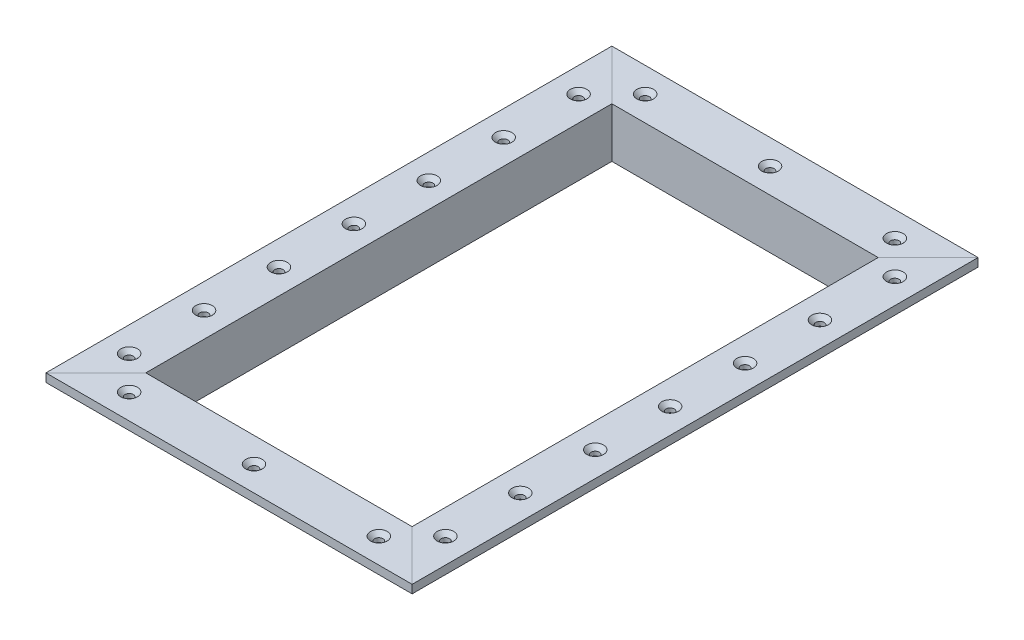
from build123d import *

# Parameters (mm, degrees)
BOSS_EXTRUDE1_DEPTH   = 88.9
BOSS_EXTRUDE1_2_DEPTH = 88.9
SKETCH2_W             = 139.7
SKETCH2_H             = 19.05
BOSS_EXTRUDE2_DEPTH   = 3.175
SKETCH3_W             = 107.95
SKETCH3_H             = 3.175
BOSS_EXTRUDE3_DEPTH   = 15.875
CUT_EXTRUDE1_DEPTH    = 178.573069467


with BuildPart() as part:
    # Sketch1 → Boss-Extrude1 (new, symmetric)
    with BuildSketch(Plane.XY):
        Polygon((0, 0), (19.05, 0), (19.05, -19.05), (15.875, -19.05), (15.875, -3.175), (0, -3.175), align=None)
    extrude(amount=BOSS_EXTRUDE1_DEPTH, both=True)



with BuildPart() as body_2:
    # Sketch1 → Boss-Extrude1 2 (new, symmetric)
    with BuildSketch(Plane.XY):
        Polygon((123.825, -19.05), (120.65, -19.05), (120.65, 0), (139.7, 0), (139.7, -3.175), (123.825, -3.175), align=None)
    extrude(amount=BOSS_EXTRUDE1_2_DEPTH, both=True)


with BuildPart() as part_1:
    add(part.part)

    add(body_2.part)  # Boss-Extrude2 merges body 2
    # Sketch2 → Boss-Extrude2 (add)
    with BuildSketch(Plane(origin=(0, 0, 0), x_dir=(1, 0, 0), z_dir=(0, 1, 0))):
        with Locations((69.85, 98.425)):
            Rectangle(SKETCH2_W, SKETCH2_H)
        with Locations((69.85, -98.425)):
            Rectangle(SKETCH2_W, SKETCH2_H)
    extrude(amount=-BOSS_EXTRUDE2_DEPTH)

    # Sketch3 → Boss-Extrude3 (add)
    with BuildSketch(Plane.XZ.offset(3.175)):
        with Locations((69.85, 90.4875)):
            Rectangle(SKETCH3_W, SKETCH3_H)
        with Locations((69.85, -90.4875)):
            Rectangle(SKETCH3_W, SKETCH3_H)
    extrude(amount=BOSS_EXTRUDE3_DEPTH)

    # Sketch4 → Cut-Extrude1 (cut, through all)
    with BuildSketch(Plane(origin=(0, 0, 0), x_dir=(1, 0, 0), z_dir=(0, 1, 0))):
        Polygon((-0.017960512, 107.932039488), (19.032039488, 88.882039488), (24.614430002, 83.299648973), (24.650351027, 83.335569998), (19.067960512, 88.917960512), (0.017960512, 107.967960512), align=None)
        Polygon((115.085569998, 83.299648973), (115.049648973, 83.335569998), (120.632039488, 88.917960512), (139.682039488, 107.967960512), (139.717960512, 107.932039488), (120.667960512, 88.882039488), align=None)
        Polygon((139.717960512, -107.932039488), (120.667960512, -88.882039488), (115.085569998, -83.299648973), (115.049648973, -83.335569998), (120.632039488, -88.917960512), (139.682039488, -107.967960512), align=None)
        Polygon((24.614430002, -83.299648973), (24.650351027, -83.335569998), (19.067960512, -88.917960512), (0.017960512, -107.967960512), (-0.017960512, -107.932039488), (19.032039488, -88.882039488), align=None)
    extrude(amount=-CUT_EXTRUDE1_DEPTH, mode=Mode.SUBTRACT)


with BuildPart() as cut_extrude1_piece_1:
    # of the separate pieces the step leaves, piece 1, a body of its own (cut_extrude1_pieces)
    add(part_1.part.solids().sort_by_distance((0, 0, -107.914078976))[0])


with BuildPart() as cut_extrude1_piece_2:
    # of the separate pieces the step leaves, piece 2, a body of its own (cut_extrude1_pieces)
    add(part_1.part.solids().sort_by_distance((139.7, 0, -107.914078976))[0])


with BuildPart() as cut_extrude1_piece_3:
    # of the separate pieces the step leaves, piece 3, a body of its own (cut_extrude1_pieces)
    add(part_1.part.solids().sort_by_distance((0.035921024, 0, -107.95))[0])

    # Sketch6 → Cut-Revolve1 (revolve, cut)
    with BuildSketch(Plane.ZY.offset(-22.225), mode=Mode.PRIVATE) as cut_revolve1_sk:
        Polygon((-98.425, 0), (-95.25, 0), (-96.8375, -1.5875), (-96.8375, -4.279347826), (-98.425, -4.279347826), align=None)
    cut_revolve1 = revolve(cut_revolve1_sk.sketch.rotate(Axis((22.225, -4.279347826, -98.425), (0, 1, 0)), 180), axis=Axis((22.225, -4.279347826, -98.425), (0, 1, 0)), mode=Mode.SUBTRACT)


with BuildPart() as cut_extrude1_piece_4:
    # of the separate pieces the step leaves, piece 4, a body of its own (cut_extrude1_pieces)
    add(part_1.part.solids().sort_by_distance((139.664078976, 0, 107.95))[0])


with BuildPart() as sketch_pattern2_tool:
    # Sketch-Pattern2: Cut-Revolve1 at 19 more places
    with Locations((47.625, 0, 0), (95.25, 0, 0), (-12.7, 0, 12.7), (-12.7, 0, 41.275), (-12.7, 0, 69.85), (-12.7, 0, 98.425), (-12.7, 0, 127), (-12.7, 0, 155.575), (-12.7, 0, 184.15), (0, 0, 196.85), (95.25, 0, 196.85), (107.95, 0, 184.15), (107.95, 0, 155.575), (107.95, 0, 127), (107.95, 0, 98.425), (107.95, 0, 69.85), (107.95, 0, 41.275), (107.95, 0, 12.7), (47.625, 0, 196.85)):
        add(cut_revolve1)


with BuildPart() as cut_extrude1_piece_1_1:
    add(cut_extrude1_piece_1.part)

    # Sketch-Pattern2: cut by sketch_pattern2_tool
    add(sketch_pattern2_tool.part, mode=Mode.SUBTRACT)


with BuildPart() as cut_extrude1_piece_2_1:
    add(cut_extrude1_piece_2.part)

    # Sketch-Pattern2: cut by sketch_pattern2_tool
    add(sketch_pattern2_tool.part, mode=Mode.SUBTRACT)


with BuildPart() as cut_extrude1_piece_3_1:
    add(cut_extrude1_piece_3.part)

    # Sketch-Pattern2: cut by sketch_pattern2_tool
    add(sketch_pattern2_tool.part, mode=Mode.SUBTRACT)


with BuildPart() as cut_extrude1_piece_4_1:
    add(cut_extrude1_piece_4.part)

    # Sketch-Pattern2: cut by sketch_pattern2_tool
    add(sketch_pattern2_tool.part, mode=Mode.SUBTRACT)


solid = Compound([cut_extrude1_piece_1_1.part, cut_extrude1_piece_2_1.part, cut_extrude1_piece_3_1.part, cut_extrude1_piece_4_1.part])
